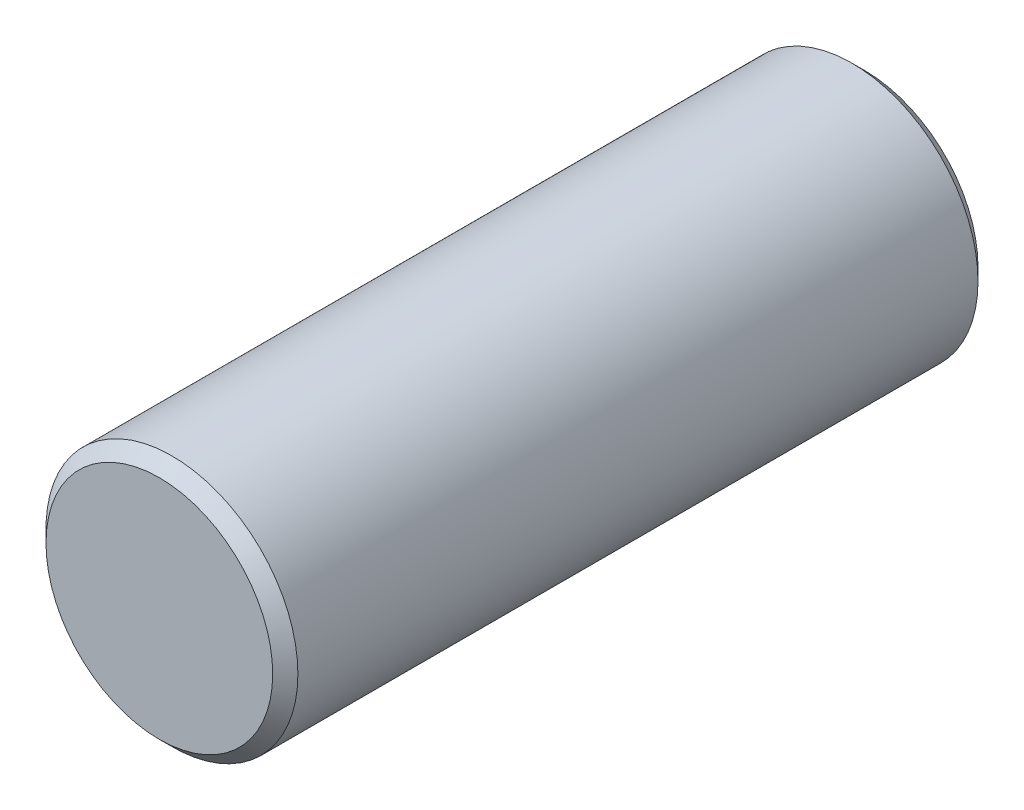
from build123d import *

# Parameters (mm, degrees)
ESQUISSE1_R          = 5
BASE_EXTRUSION_DEPTH = 28
CHANFREIN1_SIZE      = 0.5


with BuildPart() as part:
    # Esquisse1 → Base-Extrusion (new body)
    with BuildSketch(Plane.XY):
        Circle(ESQUISSE1_R)
    extrude(amount=BASE_EXTRUSION_DEPTH)

    # Chanfrein1
    chanfrein1_edges = [part.edges().sort_by_distance(p)[0] for p in [
        (-5, 0, 0),
        (-5, 0, 28),
    ]]
    chamfer(chanfrein1_edges, length=CHANFREIN1_SIZE)


solid = part.part
